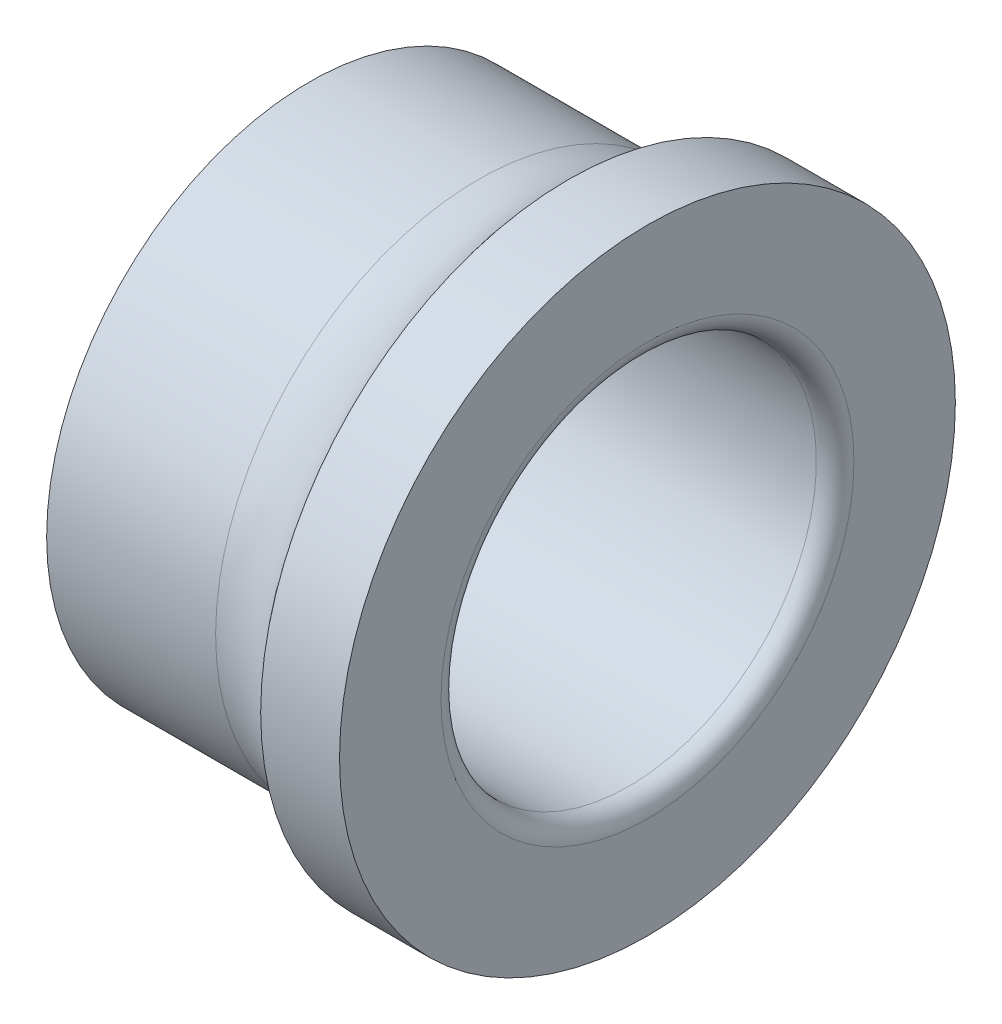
ISO-10303-21;
HEADER;
FILE_DESCRIPTION(('STEP AP214'),'2;1');
FILE_NAME('part.step','',(''),(''),'','','');
FILE_SCHEMA(('AUTOMOTIVE_DESIGN { 1 0 10303 214 1 1 1 1 }'));
ENDSEC;
DATA;
#1=APPLICATION_CONTEXT('core data for automotive mechanical design processes');
#2=APPLICATION_PROTOCOL_DEFINITION('international standard','automotive_design',2000,#1);
#3=PRODUCT_CONTEXT('',#1,'mechanical');
#4=PRODUCT('Part','Part','',(#3));
#5=PRODUCT_RELATED_PRODUCT_CATEGORY('part','',(#4));
#6=PRODUCT_DEFINITION_FORMATION('','',#4);
#7=PRODUCT_DEFINITION_CONTEXT('part definition',#1,'design');
#8=PRODUCT_DEFINITION('design','',#6,#7);
#9=PRODUCT_DEFINITION_SHAPE('','',#8);
#10=(LENGTH_UNIT() NAMED_UNIT(*) SI_UNIT(.MILLI.,.METRE.));
#11=(NAMED_UNIT(*) PLANE_ANGLE_UNIT() SI_UNIT($,.RADIAN.));
#12=(NAMED_UNIT(*) SI_UNIT($,.STERADIAN.) SOLID_ANGLE_UNIT());
#13=UNCERTAINTY_MEASURE_WITH_UNIT(LENGTH_MEASURE(1.E-05),#10,'distance_accuracy_value','');
#14=(GEOMETRIC_REPRESENTATION_CONTEXT(3) GLOBAL_UNCERTAINTY_ASSIGNED_CONTEXT((#13)) GLOBAL_UNIT_ASSIGNED_CONTEXT((#10,
#11,#12)) REPRESENTATION_CONTEXT('',''));
#15=CARTESIAN_POINT('',(0.,0.,0.));
#16=DIRECTION('',(0.,0.,1.));
#17=DIRECTION('',(1.,0.,0.));
#18=AXIS2_PLACEMENT_3D('',#15,#16,#17);
#19=CARTESIAN_POINT('',(4.5,0.,0.));
#20=DIRECTION('',(-1.,0.,0.));
#21=DIRECTION('',(0.,0.,1.));
#22=AXIS2_PLACEMENT_3D('',#19,#20,#21);
#23=CYLINDRICAL_SURFACE('',#22,5.);
#24=CARTESIAN_POINT('',(0.5,0.,0.));
#25=DIRECTION('',(-1.,0.,0.));
#26=DIRECTION('',(0.,0.,1.));
#27=AXIS2_PLACEMENT_3D('',#24,#25,#26);
#28=CIRCLE('',#27,5.);
#29=CARTESIAN_POINT('',(0.5,0.,5.));
#30=VERTEX_POINT('',#29);
#31=EDGE_CURVE('E68',#30,#30,#28,.F.);
#32=ORIENTED_EDGE('',*,*,#31,.F.);
#33=EDGE_LOOP('',(#32));
#34=FACE_BOUND('',#33,.T.);
#35=CARTESIAN_POINT('',(8.5,0.,0.));
#36=DIRECTION('',(-1.,0.,0.));
#37=DIRECTION('',(0.,0.,1.));
#38=AXIS2_PLACEMENT_3D('',#35,#36,#37);
#39=CIRCLE('',#38,5.);
#40=CARTESIAN_POINT('',(8.5,0.,5.));
#41=VERTEX_POINT('',#40);
#42=EDGE_CURVE('E65',#41,#41,#39,.T.);
#43=ORIENTED_EDGE('',*,*,#42,.F.);
#44=EDGE_LOOP('',(#43));
#45=FACE_BOUND('',#44,.T.);
#46=ADVANCED_FACE('F14',(#34,#45),#23,.F.);
#47=CARTESIAN_POINT('',(0.5,0.,0.));
#48=DIRECTION('',(-1.,0.,0.));
#49=DIRECTION('',(0.,0.,1.));
#50=AXIS2_PLACEMENT_3D('',#47,#48,#49);
#51=TOROIDAL_SURFACE('',#50,5.5,0.5);
#52=CARTESIAN_POINT('',(0.,0.,0.));
#53=DIRECTION('',(-1.,0.,0.));
#54=DIRECTION('',(0.,0.,-1.));
#55=AXIS2_PLACEMENT_3D('',#52,#53,#54);
#56=CIRCLE('',#55,5.5);
#57=CARTESIAN_POINT('',(0.,0.,-5.5));
#58=VERTEX_POINT('',#57);
#59=EDGE_CURVE('E38',#58,#58,#56,.F.);
#60=ORIENTED_EDGE('',*,*,#59,.F.);
#61=EDGE_LOOP('',(#60));
#62=FACE_BOUND('',#61,.T.);
#63=ORIENTED_EDGE('',*,*,#31,.T.);
#64=EDGE_LOOP('',(#63));
#65=FACE_BOUND('',#64,.T.);
#66=ADVANCED_FACE('F58',(#62,#65),#51,.T.);
#67=CARTESIAN_POINT('',(8.5,0.,0.));
#68=DIRECTION('',(-1.,0.,0.));
#69=DIRECTION('',(0.,0.,1.));
#70=AXIS2_PLACEMENT_3D('',#67,#68,#69);
#71=TOROIDAL_SURFACE('',#70,5.5,0.500000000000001);
#72=ORIENTED_EDGE('',*,*,#42,.T.);
#73=EDGE_LOOP('',(#72));
#74=FACE_BOUND('',#73,.T.);
#75=CARTESIAN_POINT('',(9.,0.,0.));
#76=DIRECTION('',(1.,0.,0.));
#77=DIRECTION('',(0.,0.,-1.));
#78=AXIS2_PLACEMENT_3D('',#75,#76,#77);
#79=CIRCLE('',#78,5.5);
#80=CARTESIAN_POINT('',(9.,0.,-5.5));
#81=VERTEX_POINT('',#80);
#82=EDGE_CURVE('E72',#81,#81,#79,.F.);
#83=ORIENTED_EDGE('',*,*,#82,.F.);
#84=EDGE_LOOP('',(#83));
#85=FACE_BOUND('',#84,.T.);
#86=ADVANCED_FACE('F53',(#74,#85),#71,.T.);
#87=CARTESIAN_POINT('',(0.,6.25,0.));
#88=DIRECTION('',(-1.,0.,0.));
#89=DIRECTION('',(0.,0.,1.));
#90=AXIS2_PLACEMENT_3D('',#87,#88,#89);
#91=PLANE('',#90);
#92=ORIENTED_EDGE('',*,*,#59,.T.);
#93=EDGE_LOOP('',(#92));
#94=FACE_BOUND('',#93,.T.);
#95=CARTESIAN_POINT('',(0.,0.,0.));
#96=DIRECTION('',(-1.,0.,0.));
#97=DIRECTION('',(0.,0.,1.));
#98=AXIS2_PLACEMENT_3D('',#95,#96,#97);
#99=CIRCLE('',#98,7.);
#100=CARTESIAN_POINT('',(0.,0.,7.));
#101=VERTEX_POINT('',#100);
#102=EDGE_CURVE('E17',#101,#101,#99,.F.);
#103=ORIENTED_EDGE('',*,*,#102,.F.);
#104=EDGE_LOOP('',(#103));
#105=FACE_BOUND('',#104,.T.);
#106=ADVANCED_FACE('F43',(#94,#105),#91,.T.);
#107=CARTESIAN_POINT('',(9.,6.85,0.));
#108=DIRECTION('',(1.,0.,0.));
#109=DIRECTION('',(0.,0.,-1.));
#110=AXIS2_PLACEMENT_3D('',#107,#108,#109);
#111=PLANE('',#110);
#112=ORIENTED_EDGE('',*,*,#82,.T.);
#113=EDGE_LOOP('',(#112));
#114=FACE_BOUND('',#113,.T.);
#115=CARTESIAN_POINT('',(9.,0.,0.));
#116=DIRECTION('',(-1.,0.,0.));
#117=DIRECTION('',(0.,0.,1.));
#118=AXIS2_PLACEMENT_3D('',#115,#116,#117);
#119=CIRCLE('',#118,8.2);
#120=CARTESIAN_POINT('',(9.,0.,8.2));
#121=VERTEX_POINT('',#120);
#122=EDGE_CURVE('E26',#121,#121,#119,.T.);
#123=ORIENTED_EDGE('',*,*,#122,.F.);
#124=EDGE_LOOP('',(#123));
#125=FACE_BOUND('',#124,.T.);
#126=ADVANCED_FACE('F52',(#114,#125),#111,.T.);
#127=CARTESIAN_POINT('',(2.25,0.,0.));
#128=DIRECTION('',(-1.,0.,0.));
#129=DIRECTION('',(0.,0.,1.));
#130=AXIS2_PLACEMENT_3D('',#127,#128,#129);
#131=CYLINDRICAL_SURFACE('',#130,7.);
#132=ORIENTED_EDGE('',*,*,#102,.T.);
#133=EDGE_LOOP('',(#132));
#134=FACE_BOUND('',#133,.T.);
#135=CARTESIAN_POINT('',(4.5,0.,0.));
#136=DIRECTION('',(-1.,0.,0.));
#137=DIRECTION('',(0.,0.,1.));
#138=AXIS2_PLACEMENT_3D('',#135,#136,#137);
#139=CIRCLE('',#138,7.);
#140=CARTESIAN_POINT('',(4.5,0.,7.));
#141=VERTEX_POINT('',#140);
#142=EDGE_CURVE('E21',#141,#141,#139,.T.);
#143=ORIENTED_EDGE('',*,*,#142,.T.);
#144=EDGE_LOOP('',(#143));
#145=FACE_BOUND('',#144,.T.);
#146=ADVANCED_FACE('F110',(#134,#145),#131,.T.);
#147=CARTESIAN_POINT('',(7.95,0.,0.));
#148=DIRECTION('',(-1.,0.,0.));
#149=DIRECTION('',(0.,0.,1.));
#150=AXIS2_PLACEMENT_3D('',#147,#148,#149);
#151=CYLINDRICAL_SURFACE('',#150,8.2);
#152=ORIENTED_EDGE('',*,*,#122,.T.);
#153=EDGE_LOOP('',(#152));
#154=FACE_BOUND('',#153,.T.);
#155=CARTESIAN_POINT('',(6.9,0.,0.));
#156=DIRECTION('',(-1.,0.,0.));
#157=DIRECTION('',(0.,0.,1.));
#158=AXIS2_PLACEMENT_3D('',#155,#156,#157);
#159=CIRCLE('',#158,8.2);
#160=CARTESIAN_POINT('',(6.9,0.,8.2));
#161=VERTEX_POINT('',#160);
#162=EDGE_CURVE('E10',#161,#161,#159,.F.);
#163=ORIENTED_EDGE('',*,*,#162,.T.);
#164=EDGE_LOOP('',(#163));
#165=FACE_BOUND('',#164,.T.);
#166=ADVANCED_FACE('F107',(#154,#165),#151,.T.);
#167=CARTESIAN_POINT('',(4.5,0.,0.));
#168=DIRECTION('',(-1.,0.,0.));
#169=DIRECTION('',(0.,0.,1.));
#170=AXIS2_PLACEMENT_3D('',#167,#168,#169);
#171=TOROIDAL_SURFACE('',#170,10.,3.);
#172=ORIENTED_EDGE('',*,*,#162,.F.);
#173=EDGE_LOOP('',(#172));
#174=FACE_BOUND('',#173,.T.);
#175=ORIENTED_EDGE('',*,*,#142,.F.);
#176=EDGE_LOOP('',(#175));
#177=FACE_BOUND('',#176,.T.);
#178=ADVANCED_FACE('F104',(#174,#177),#171,.F.);
#179=CLOSED_SHELL('',(#46,#66,#86,#106,#126,#146,#166,#178));
#180=MANIFOLD_SOLID_BREP('B1',#179);
#181=ADVANCED_BREP_SHAPE_REPRESENTATION('',(#18,#180),#14);
#182=SHAPE_DEFINITION_REPRESENTATION(#9,#181);
ENDSEC;
END-ISO-10303-21;
